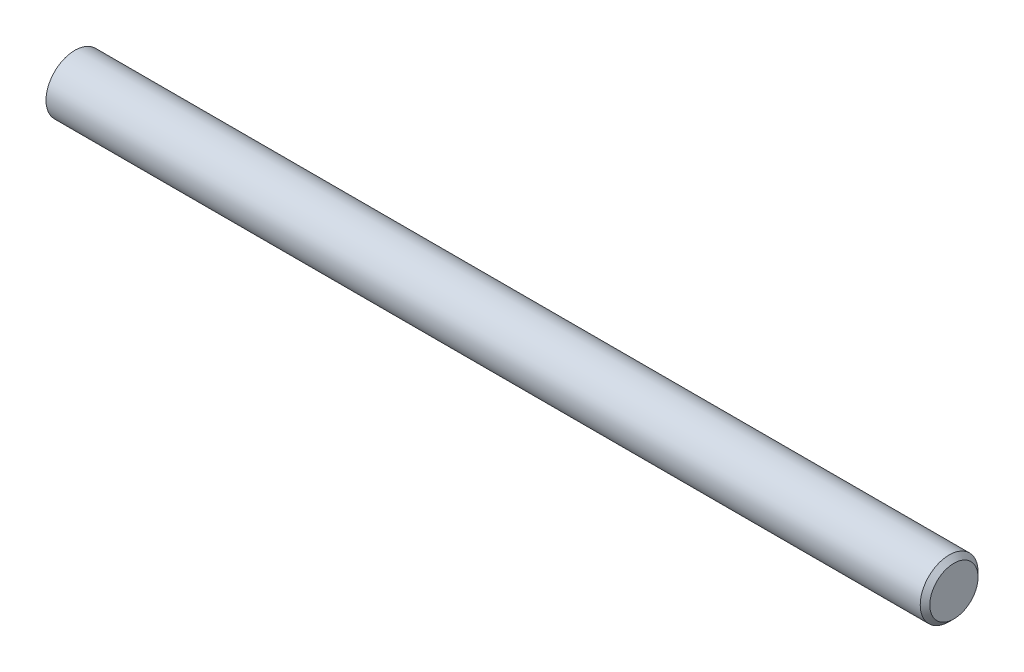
from build123d import *


with BuildPart() as part:
    # BodySke → Base-Revolve (revolve)
    with BuildSketch(Plane.XY, mode=Mode.PRIVATE) as base_revolve_sk:
        Polygon((0, 0), (0, 5), (151.172, 5), (152, 4.172), (152, 0), align=None)
    revolve(base_revolve_sk.sketch.rotate(Axis((-31.75, 0, 0), (1, 0, 0)), 90), axis=Axis((-31.75, 0, 0), (1, 0, 0)))


solid = part.part
